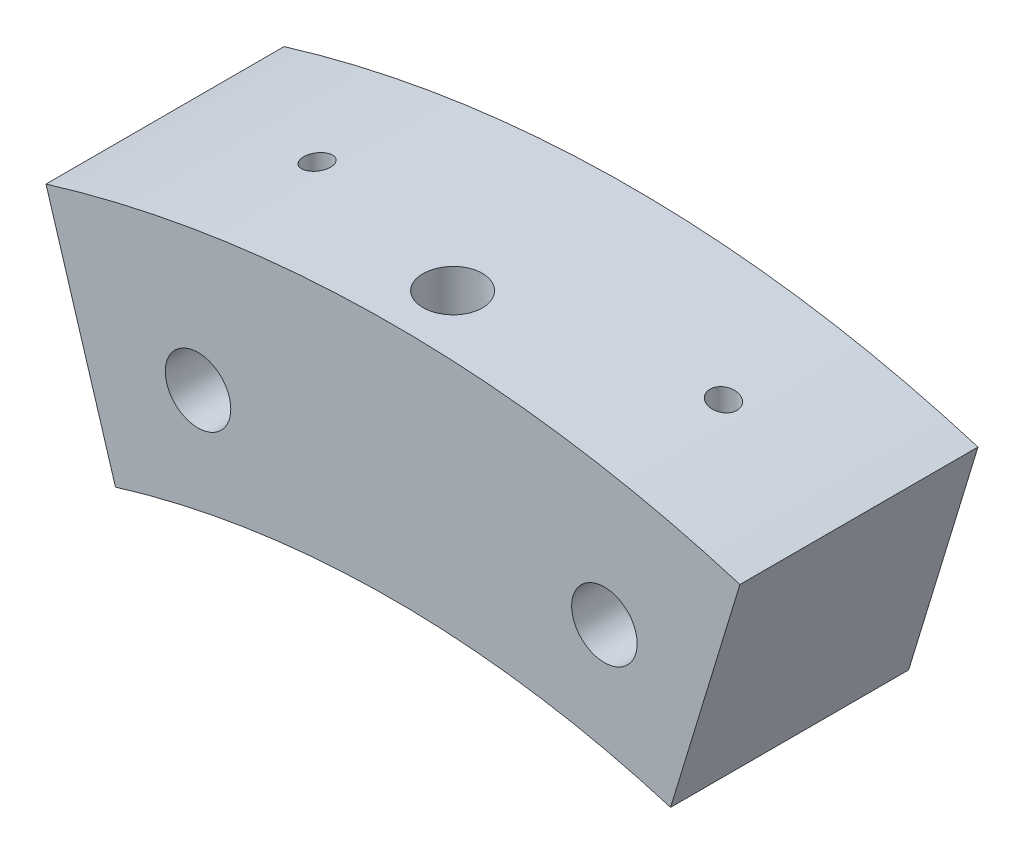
from build123d import *

# Parameters (mm, degrees)
BOSS_EXTRUDE1_DEPTH       = 23.8252
SKETCH3_R                 = 1.78435
CUT_EXTRUDE1_DEPTH        = 51.570482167
F_6_32_TAPPED_HOLE1_D     = 2.7051
F_6_32_TAPPED_HOLE1_DEPTH = 17.9832
F_6_32_TAPPED_HOLE1_TIP   = 0.81269403
SKETCH7_R                 = 3.2766
CUT_EXTRUDE2_DEPTH        = 127.308793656
SKETCH8_R                 = 2.9718
CUT_EXTRUDE3_DEPTH        = 5.461


with BuildPart() as part:
    # Sketch1 → Boss-Extrude1 (new body)
    with BuildSketch(Plane.XY):
        with BuildLine():
            Line((27.754159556, 91.116788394), (34.6964, 113.908134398))
            ThreePointArc((34.6964, 113.908134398), (-0.026553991, 119.075197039), (-34.7472, 113.892648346))
            Line((-34.7472, 113.892648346), (-27.794795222, 91.104400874))
            ThreePointArc((-27.794795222, 91.104400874), (-0.021240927, 95.249997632), (27.754159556, 91.116788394))
        make_face()
    extrude(amount=BOSS_EXTRUDE1_DEPTH)

    # Sketch3 → Cut-Extrude1 (cut, through all)
    with BuildSketch(Plane(origin=(0, 119.0752, 0), x_dir=(-1, 0, 0), z_dir=(0, 1, 0))):
        with Locations(Location((0, 17.8816, 0), (0, 0, 90))):
            Circle(SKETCH3_R)
    extrude(amount=-CUT_EXTRUDE1_DEPTH, mode=Mode.SUBTRACT)

    # 6-32 Tapped Hole1
    with Locations(Plane(origin=(0, 119.0752, 0), x_dir=(-1, 0, 0), z_dir=(0, 1, 0))):
        with Locations((19.5326, 11.9126), (-21.1328, 11.9126)):
            Hole(F_6_32_TAPPED_HOLE1_D / 2, depth=F_6_32_TAPPED_HOLE1_DEPTH)
            with Locations((0, 0, -(F_6_32_TAPPED_HOLE1_DEPTH + F_6_32_TAPPED_HOLE1_TIP / 2))):  # 118° drill point
                Cone(0, F_6_32_TAPPED_HOLE1_D / 2, F_6_32_TAPPED_HOLE1_TIP, mode=Mode.SUBTRACT)

    # Sketch7 → Cut-Extrude2 (cut, through all)
    with BuildSketch(Plane.XY.offset(23.8252)):
        with Locations((-19.5326, 103.632)):
            Circle(SKETCH7_R)
        with Locations((21.1328, 103.632)):
            Circle(SKETCH7_R)
    extrude(amount=-CUT_EXTRUDE2_DEPTH, mode=Mode.SUBTRACT)

    # Sketch8 → Cut-Extrude3 (cut)
    with BuildSketch(Plane(origin=(0, 119.0752, 0), x_dir=(-1, 0, 0), z_dir=(0, 1, 0))):
        with Locations(Location((0, 17.8816, 0), (0, 0, 90))):
            Circle(SKETCH8_R)
    extrude(amount=-CUT_EXTRUDE3_DEPTH, mode=Mode.SUBTRACT)


solid = part.part
